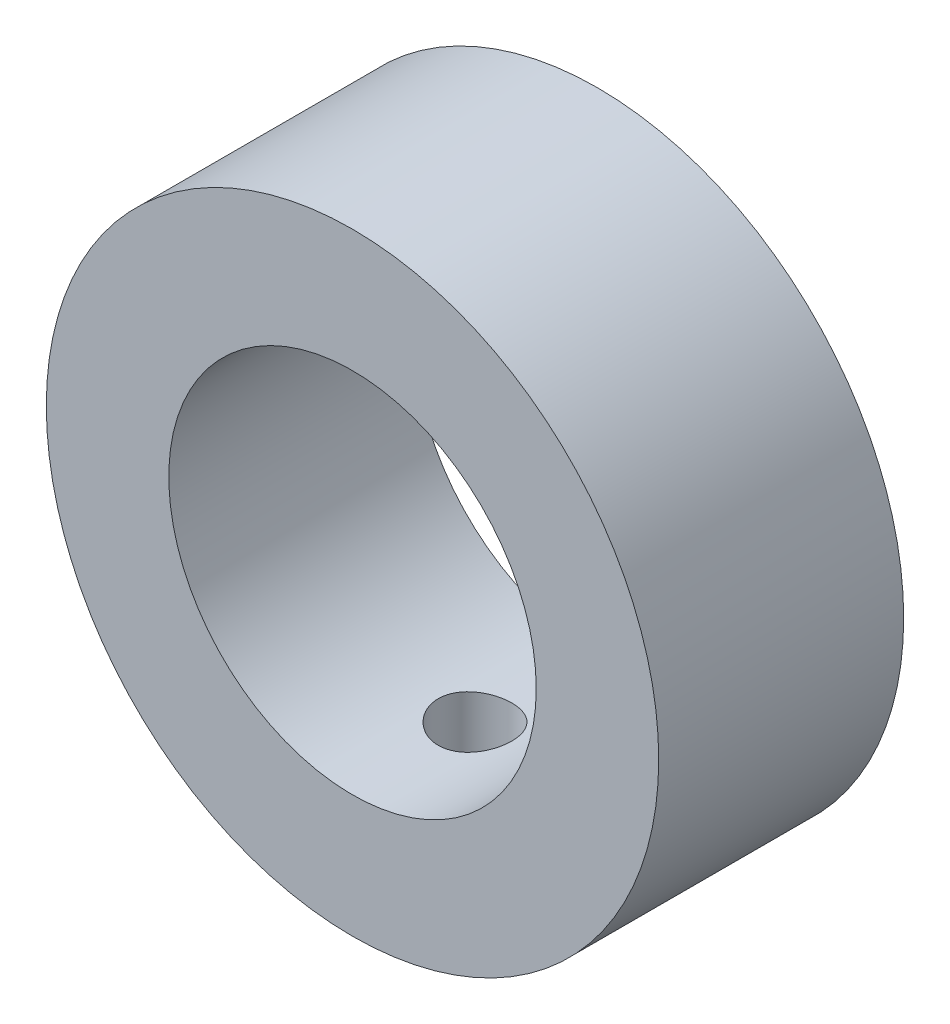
ISO-10303-21;
HEADER;
FILE_DESCRIPTION(('STEP AP214'),'2;1');
FILE_NAME('part.step','',(''),(''),'','','');
FILE_SCHEMA(('AUTOMOTIVE_DESIGN { 1 0 10303 214 1 1 1 1 }'));
ENDSEC;
DATA;
#1=APPLICATION_CONTEXT('core data for automotive mechanical design processes');
#2=APPLICATION_PROTOCOL_DEFINITION('international standard','automotive_design',2000,#1);
#3=PRODUCT_CONTEXT('',#1,'mechanical');
#4=PRODUCT('Part','Part','',(#3));
#5=PRODUCT_RELATED_PRODUCT_CATEGORY('part','',(#4));
#6=PRODUCT_DEFINITION_FORMATION('','',#4);
#7=PRODUCT_DEFINITION_CONTEXT('part definition',#1,'design');
#8=PRODUCT_DEFINITION('design','',#6,#7);
#9=PRODUCT_DEFINITION_SHAPE('','',#8);
#10=(LENGTH_UNIT() NAMED_UNIT(*) SI_UNIT(.MILLI.,.METRE.));
#11=(NAMED_UNIT(*) PLANE_ANGLE_UNIT() SI_UNIT($,.RADIAN.));
#12=(NAMED_UNIT(*) SI_UNIT($,.STERADIAN.) SOLID_ANGLE_UNIT());
#13=UNCERTAINTY_MEASURE_WITH_UNIT(LENGTH_MEASURE(1.E-05),#10,'distance_accuracy_value','');
#14=(GEOMETRIC_REPRESENTATION_CONTEXT(3) GLOBAL_UNCERTAINTY_ASSIGNED_CONTEXT((#13)) GLOBAL_UNIT_ASSIGNED_CONTEXT((#10,
#11,#12)) REPRESENTATION_CONTEXT('',''));
#15=CARTESIAN_POINT('',(0.,0.,0.));
#16=DIRECTION('',(0.,0.,1.));
#17=DIRECTION('',(1.,0.,0.));
#18=AXIS2_PLACEMENT_3D('',#15,#16,#17);
#19=CARTESIAN_POINT('',(0.,0.,10.));
#20=DIRECTION('',(0.,0.,-1.));
#21=DIRECTION('',(-1.,0.,0.));
#22=AXIS2_PLACEMENT_3D('',#19,#20,#21);
#23=CYLINDRICAL_SURFACE('',#22,25.);
#24=CARTESIAN_POINT('',(0.,-25.,3.));
#25=CARTESIAN_POINT('',(-0.167864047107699,-24.9999977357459,2.99999283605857));
#26=CARTESIAN_POINT('',(-0.335834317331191,-24.9982914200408,2.98586334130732));
#27=CARTESIAN_POINT('',(-0.66710457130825,-24.991648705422,2.92971893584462));
#28=CARTESIAN_POINT('',(-0.830399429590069,-24.9867088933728,2.88767455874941));
#29=CARTESIAN_POINT('',(-1.14747479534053,-24.9741559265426,2.77695372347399));
#30=CARTESIAN_POINT('',(-1.30126148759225,-24.9665445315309,2.70829479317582));
#31=CARTESIAN_POINT('',(-1.595099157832,-24.9494959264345,2.5463312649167));
#32=CARTESIAN_POINT('',(-1.73515256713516,-24.9400590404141,2.45303104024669));
#33=CARTESIAN_POINT('',(-1.99829131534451,-24.920360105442,2.24392513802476));
#34=CARTESIAN_POINT('',(-2.1212966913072,-24.9100945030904,2.12801915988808));
#35=CARTESIAN_POINT('',(-2.34615931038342,-24.8899239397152,1.8772070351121));
#36=CARTESIAN_POINT('',(-2.44801549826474,-24.8800189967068,1.74229994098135));
#37=CARTESIAN_POINT('',(-2.62798342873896,-24.8616560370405,1.45679917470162));
#38=CARTESIAN_POINT('',(-2.7060207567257,-24.8532025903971,1.30615827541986));
#39=CARTESIAN_POINT('',(-2.8356605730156,-24.8387461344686,0.993791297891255));
#40=CARTESIAN_POINT('',(-2.88726398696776,-24.8327430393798,0.832065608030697));
#41=CARTESIAN_POINT('',(-2.96232930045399,-24.8239006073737,0.502947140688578));
#42=CARTESIAN_POINT('',(-2.98592577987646,-24.8210461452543,0.335585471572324));
#43=CARTESIAN_POINT('',(-3.0047237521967,-24.8187777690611,-0.000744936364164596));
#44=CARTESIAN_POINT('',(-2.99992630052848,-24.8193637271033,-0.169713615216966));
#45=CARTESIAN_POINT('',(-2.96218316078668,-24.8238961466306,-0.50352596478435));
#46=CARTESIAN_POINT('',(-2.92938543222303,-24.8278249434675,-0.668386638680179));
#47=CARTESIAN_POINT('',(-2.83680346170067,-24.8385728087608,-0.990247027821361));
#48=CARTESIAN_POINT('',(-2.77701871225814,-24.8453919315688,-1.147246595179));
#49=CARTESIAN_POINT('',(-2.63199980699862,-24.8611722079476,-1.44938946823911));
#50=CARTESIAN_POINT('',(-2.54670106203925,-24.8701387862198,-1.59450147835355));
#51=CARTESIAN_POINT('',(-2.35312173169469,-24.8891993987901,-1.86840721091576));
#52=CARTESIAN_POINT('',(-2.24484017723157,-24.8992934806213,-1.99720024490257));
#53=CARTESIAN_POINT('',(-2.0075475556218,-24.9195503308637,-2.23567108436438));
#54=CARTESIAN_POINT('',(-1.87840890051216,-24.929713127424,-2.34522196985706));
#55=CARTESIAN_POINT('',(-1.60350795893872,-24.9489020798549,-2.54111152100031));
#56=CARTESIAN_POINT('',(-1.45774563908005,-24.9579282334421,-2.62745014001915));
#57=CARTESIAN_POINT('',(-1.15363930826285,-24.9738318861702,-2.77446328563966));
#58=CARTESIAN_POINT('',(-0.995291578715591,-24.9807087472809,-2.83513019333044));
#59=CARTESIAN_POINT('',(-0.67055602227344,-24.991533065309,-2.9289787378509));
#60=CARTESIAN_POINT('',(-0.504168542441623,-24.9954806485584,-2.96216156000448));
#61=CARTESIAN_POINT('',(-0.169174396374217,-24.9999852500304,-2.99993625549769));
#62=CARTESIAN_POINT('',(-0.000587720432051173,-25.0005630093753,-3.0047030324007));
#63=CARTESIAN_POINT('',(0.33498206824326,-24.9983187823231,-2.98597142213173));
#64=CARTESIAN_POINT('',(0.501965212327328,-24.9954968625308,-2.96247358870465));
#65=CARTESIAN_POINT('',(0.829074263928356,-24.9867833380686,-2.88802503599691));
#66=CARTESIAN_POINT('',(0.989219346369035,-24.9809010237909,-2.83715738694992));
#67=CARTESIAN_POINT('',(1.29870539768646,-24.9667255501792,-2.70949929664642));
#68=CARTESIAN_POINT('',(1.44804602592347,-24.9584323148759,-2.63270803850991));
#69=CARTESIAN_POINT('',(1.73246717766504,-24.9403085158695,-2.45495708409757));
#70=CARTESIAN_POINT('',(1.86747628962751,-24.9304708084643,-2.35388386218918));
#71=CARTESIAN_POINT('',(2.11867625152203,-24.9103817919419,-2.13059915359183));
#72=CARTESIAN_POINT('',(2.23486641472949,-24.9001304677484,-2.00838689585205));
#73=CARTESIAN_POINT('',(2.44574795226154,-24.8803059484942,-1.74552438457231));
#74=CARTESIAN_POINT('',(2.54032363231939,-24.8707365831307,-1.60478098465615));
#75=CARTESIAN_POINT('',(2.70449314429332,-24.8534214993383,-1.30930497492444));
#76=CARTESIAN_POINT('',(2.77408744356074,-24.8456757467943,-1.15457262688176));
#77=CARTESIAN_POINT('',(2.88612996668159,-24.8329105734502,-0.835889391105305));
#78=CARTESIAN_POINT('',(2.92864420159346,-24.8278845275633,-0.671961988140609));
#79=CARTESIAN_POINT('',(2.98553272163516,-24.8211085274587,-0.339231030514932));
#80=CARTESIAN_POINT('',(2.99990820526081,-24.8193584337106,-0.170427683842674));
#81=CARTESIAN_POINT('',(3.00009033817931,-24.819336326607,0.166112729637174));
#82=CARTESIAN_POINT('',(2.98607873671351,-24.8210421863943,0.333849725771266));
#83=CARTESIAN_POINT('',(2.93026848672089,-24.8276922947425,0.664566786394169));
#84=CARTESIAN_POINT('',(2.88846982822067,-24.8326365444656,0.827546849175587));
#85=CARTESIAN_POINT('',(2.77832739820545,-24.8451996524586,1.1441045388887));
#86=CARTESIAN_POINT('',(2.70999165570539,-24.8528177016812,1.29768499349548));
#87=CARTESIAN_POINT('',(2.5487328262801,-24.8698714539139,1.5912277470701));
#88=CARTESIAN_POINT('',(2.45580952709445,-24.8793071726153,1.73118992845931));
#89=CARTESIAN_POINT('',(2.24733689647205,-24.8990055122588,1.99445294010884));
#90=CARTESIAN_POINT('',(2.1316520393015,-24.9092728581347,2.11764610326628));
#91=CARTESIAN_POINT('',(1.88122093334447,-24.9294354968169,2.34294247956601));
#92=CARTESIAN_POINT('',(1.74647018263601,-24.939330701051,2.44504069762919));
#93=CARTESIAN_POINT('',(1.46119322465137,-24.9576721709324,2.62555057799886));
#94=CARTESIAN_POINT('',(1.31061323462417,-24.966113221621,2.70387772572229));
#95=CARTESIAN_POINT('',(0.998422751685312,-24.9805418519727,2.83402376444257));
#96=CARTESIAN_POINT('',(0.836824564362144,-24.9865321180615,2.88587169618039));
#97=CARTESIAN_POINT('',(0.561977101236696,-24.9939268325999,2.94906342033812));
#98=CARTESIAN_POINT('',(0.450466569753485,-24.996193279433,2.96813748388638));
#99=CARTESIAN_POINT('',(0.225986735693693,-24.9992306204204,2.99360814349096));
#100=CARTESIAN_POINT('',(0.113017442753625,-25.0000015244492,3.00000482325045));
#101=CARTESIAN_POINT('',(0.,-25.,3.));
#102=B_SPLINE_CURVE_WITH_KNOTS('',3,(#24,#25,#26,#27,#28,#29,#30,#31,#32,#33,#34,#35,#36,#37,
#38,#39,#40,#41,#42,#43,#44,#45,#46,#47,#48,#49,#50,#51,#52,#53,#54,#55,#56,#57,#58,#59,#60,#61,
#62,#63,#64,#65,#66,#67,#68,#69,#70,#71,#72,#73,#74,#75,#76,#77,#78,#79,#80,#81,#82,#83,#84,#85,
#86,#87,#88,#89,#90,#91,#92,#93,#94,#95,#96,#97,#98,#99,#100,#101),.UNSPECIFIED.,.T.,.F.,(4,2,2,
2,2,2,2,2,2,2,2,2,2,2,2,2,2,2,2,2,2,2,2,2,2,2,2,2,2,2,2,2,2,2,2,2,2,2,4),(0.,0.50317935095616,
1.00689069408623,1.5102708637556,2.01356175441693,2.51913872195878,3.02474090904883,
3.53190689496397,4.03905511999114,4.54375638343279,5.0484388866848,5.55047092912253,
6.05251241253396,6.55583573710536,7.05918028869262,7.56572944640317,8.07227962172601,
8.57898002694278,9.08565857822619,9.58921522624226,10.0927620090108,10.5947890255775,
11.0968318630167,11.6012692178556,12.1057249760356,12.6128207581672,13.119907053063,
13.6257524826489,14.1315763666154,14.6341719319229,15.1367676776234,15.6392114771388,
16.1416596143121,16.6471952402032,17.1528504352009,17.6602829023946,18.1671576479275,
18.5059342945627,18.8447087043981),.UNSPECIFIED.);
#103=CARTESIAN_POINT('',(0.,-25.,3.));
#104=VERTEX_POINT('',#103);
#105=EDGE_CURVE('E48',#104,#104,#102,.T.);
#106=ORIENTED_EDGE('',*,*,#105,.F.);
#107=EDGE_LOOP('',(#106));
#108=FACE_BOUND('',#107,.T.);
#109=CARTESIAN_POINT('',(0.,0.,10.));
#110=DIRECTION('',(0.,0.,1.));
#111=DIRECTION('',(1.,0.,0.));
#112=AXIS2_PLACEMENT_3D('',#109,#110,#111);
#113=CIRCLE('',#112,25.);
#114=CARTESIAN_POINT('',(25.,0.,10.));
#115=VERTEX_POINT('',#114);
#116=EDGE_CURVE('E10',#115,#115,#113,.T.);
#117=ORIENTED_EDGE('',*,*,#116,.F.);
#118=EDGE_LOOP('',(#117));
#119=FACE_BOUND('',#118,.T.);
#120=CARTESIAN_POINT('',(0.,0.,-10.));
#121=DIRECTION('',(0.,0.,1.));
#122=DIRECTION('',(1.,0.,0.));
#123=AXIS2_PLACEMENT_3D('',#120,#121,#122);
#124=CIRCLE('',#123,25.);
#125=CARTESIAN_POINT('',(25.,0.,-10.));
#126=VERTEX_POINT('',#125);
#127=EDGE_CURVE('E34',#126,#126,#124,.T.);
#128=ORIENTED_EDGE('',*,*,#127,.T.);
#129=EDGE_LOOP('',(#128));
#130=FACE_BOUND('',#129,.T.);
#131=ADVANCED_FACE('F31',(#108,#119,#130),#23,.T.);
#132=CARTESIAN_POINT('',(0.,0.,10.));
#133=DIRECTION('',(0.,0.,1.));
#134=DIRECTION('',(1.,0.,0.));
#135=AXIS2_PLACEMENT_3D('',#132,#133,#134);
#136=PLANE('',#135);
#137=CARTESIAN_POINT('',(0.,0.,10.));
#138=DIRECTION('',(0.,0.,1.));
#139=DIRECTION('',(1.,0.,0.));
#140=AXIS2_PLACEMENT_3D('',#137,#138,#139);
#141=CIRCLE('',#140,15.);
#142=CARTESIAN_POINT('',(15.,0.,10.));
#143=VERTEX_POINT('',#142);
#144=EDGE_CURVE('E45',#143,#143,#141,.T.);
#145=ORIENTED_EDGE('',*,*,#144,.F.);
#146=EDGE_LOOP('',(#145));
#147=FACE_BOUND('',#146,.T.);
#148=ORIENTED_EDGE('',*,*,#116,.T.);
#149=EDGE_LOOP('',(#148));
#150=FACE_BOUND('',#149,.T.);
#151=ADVANCED_FACE('F72',(#147,#150),#136,.T.);
#152=CARTESIAN_POINT('',(0.,0.,-10.));
#153=DIRECTION('',(0.,0.,1.));
#154=DIRECTION('',(1.,0.,0.));
#155=AXIS2_PLACEMENT_3D('',#152,#153,#154);
#156=PLANE('',#155);
#157=CARTESIAN_POINT('',(0.,0.,-10.));
#158=DIRECTION('',(0.,0.,1.));
#159=DIRECTION('',(1.,0.,0.));
#160=AXIS2_PLACEMENT_3D('',#157,#158,#159);
#161=CIRCLE('',#160,15.);
#162=CARTESIAN_POINT('',(15.,0.,-10.));
#163=VERTEX_POINT('',#162);
#164=EDGE_CURVE('E41',#163,#163,#161,.F.);
#165=ORIENTED_EDGE('',*,*,#164,.F.);
#166=EDGE_LOOP('',(#165));
#167=FACE_BOUND('',#166,.T.);
#168=ORIENTED_EDGE('',*,*,#127,.F.);
#169=EDGE_LOOP('',(#168));
#170=FACE_BOUND('',#169,.T.);
#171=ADVANCED_FACE('F70',(#167,#170),#156,.F.);
#172=CARTESIAN_POINT('',(0.,0.,-10.001));
#173=DIRECTION('',(0.,0.,1.));
#174=DIRECTION('',(1.,0.,0.));
#175=AXIS2_PLACEMENT_3D('',#172,#173,#174);
#176=CYLINDRICAL_SURFACE('',#175,15.);
#177=CARTESIAN_POINT('',(0.,-15.,3.));
#178=CARTESIAN_POINT('',(0.166730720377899,-14.9999969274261,2.99999386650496));
#179=CARTESIAN_POINT('',(0.333538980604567,-14.9971915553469,2.98605347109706));
#180=CARTESIAN_POINT('',(0.662440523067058,-14.9862709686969,2.93070449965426));
#181=CARTESIAN_POINT('',(0.824529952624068,-14.9781515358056,2.88927410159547));
#182=CARTESIAN_POINT('',(1.13919091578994,-14.9575094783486,2.78027617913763));
#183=CARTESIAN_POINT('',(1.2917714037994,-14.9449910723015,2.71273368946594));
#184=CARTESIAN_POINT('',(1.58342396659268,-14.9169119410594,2.55350325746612));
#185=CARTESIAN_POINT('',(1.72249684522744,-14.9013513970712,2.46181675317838));
#186=CARTESIAN_POINT('',(1.9850804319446,-14.8686649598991,2.2555845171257));
#187=CARTESIAN_POINT('',(2.10838185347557,-14.8515223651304,2.14077493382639));
#188=CARTESIAN_POINT('',(2.33411026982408,-14.8177254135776,1.89212275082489));
#189=CARTESIAN_POINT('',(2.43653563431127,-14.8010710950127,1.75827866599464));
#190=CARTESIAN_POINT('',(2.61849526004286,-14.7699732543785,1.47385142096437));
#191=CARTESIAN_POINT('',(2.6978128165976,-14.7555512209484,1.32312706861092));
#192=CARTESIAN_POINT('',(2.82991699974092,-14.7307880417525,1.01015454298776));
#193=CARTESIAN_POINT('',(2.88270624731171,-14.7204464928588,0.847907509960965));
#194=CARTESIAN_POINT('',(2.95957589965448,-14.7051841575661,0.518746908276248));
#195=CARTESIAN_POINT('',(2.98402349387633,-14.7001941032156,0.351922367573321));
#196=CARTESIAN_POINT('',(3.00465638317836,-14.6959912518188,0.0164705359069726));
#197=CARTESIAN_POINT('',(3.0008445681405,-14.6967778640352,-0.152156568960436));
#198=CARTESIAN_POINT('',(2.96536371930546,-14.7039765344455,-0.48374036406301));
#199=CARTESIAN_POINT('',(2.93411562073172,-14.7103035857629,-0.646744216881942));
#200=CARTESIAN_POINT('',(2.84531365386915,-14.7277363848,-0.965148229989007));
#201=CARTESIAN_POINT('',(2.78775852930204,-14.7388423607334,-1.12054802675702));
#202=CARTESIAN_POINT('',(2.64757435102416,-14.7646685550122,-1.4205457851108));
#203=CARTESIAN_POINT('',(2.56477845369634,-14.7794126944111,-1.56506363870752));
#204=CARTESIAN_POINT('',(2.37658072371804,-14.8108385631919,-1.83831254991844));
#205=CARTESIAN_POINT('',(2.27117629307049,-14.827520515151,-1.96704179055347));
#206=CARTESIAN_POINT('',(2.03849980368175,-14.8613106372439,-2.20748820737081));
#207=CARTESIAN_POINT('',(1.91086848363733,-14.8784210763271,-2.31885770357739));
#208=CARTESIAN_POINT('',(1.63855507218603,-14.9108654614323,-2.51866153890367));
#209=CARTESIAN_POINT('',(1.49387276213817,-14.9261993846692,-2.60709558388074));
#210=CARTESIAN_POINT('',(1.19117816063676,-14.9534007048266,-2.75858252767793));
#211=CARTESIAN_POINT('',(1.0331454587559,-14.9652626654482,-2.82159568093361));
#212=CARTESIAN_POINT('',(0.708446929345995,-14.9841422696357,-2.9200814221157));
#213=CARTESIAN_POINT('',(0.541782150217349,-14.9911605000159,-2.95555734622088));
#214=CARTESIAN_POINT('',(0.207538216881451,-14.999480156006,-2.99746936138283));
#215=CARTESIAN_POINT('',(0.0400209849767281,-15.0008752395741,-3.00438125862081));
#216=CARTESIAN_POINT('',(-0.293774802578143,-14.9980515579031,-2.99025042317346));
#217=CARTESIAN_POINT('',(-0.46005342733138,-14.9938331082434,-2.96920926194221));
#218=CARTESIAN_POINT('',(-0.785116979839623,-14.9803149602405,-2.90016487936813));
#219=CARTESIAN_POINT('',(-0.94395584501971,-14.9710612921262,-2.85240579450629));
#220=CARTESIAN_POINT('',(-1.251370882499,-14.948506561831,-2.73154805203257));
#221=CARTESIAN_POINT('',(-1.39994628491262,-14.9352051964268,-2.65844749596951));
#222=CARTESIAN_POINT('',(-1.68462352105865,-14.9057973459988,-2.48795252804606));
#223=CARTESIAN_POINT('',(-1.82055038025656,-14.8896585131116,-2.39027165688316));
#224=CARTESIAN_POINT('',(-2.07425405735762,-14.8564420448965,-2.17377242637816));
#225=CARTESIAN_POINT('',(-2.19202892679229,-14.8393643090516,-2.0549518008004));
#226=CARTESIAN_POINT('',(-2.40792177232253,-14.8058791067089,-1.79737994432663));
#227=CARTESIAN_POINT('',(-2.50571310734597,-14.7894858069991,-1.65835276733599));
#228=CARTESIAN_POINT('',(-2.67655626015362,-14.7595257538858,-1.36556591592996));
#229=CARTESIAN_POINT('',(-2.74960906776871,-14.7459588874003,-1.21180683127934));
#230=CARTESIAN_POINT('',(-2.86845552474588,-14.7233022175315,-0.894695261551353));
#231=CARTESIAN_POINT('',(-2.91439049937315,-14.7141892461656,-0.731397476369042));
#232=CARTESIAN_POINT('',(-2.97812595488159,-14.7014231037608,-0.399199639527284));
#233=CARTESIAN_POINT('',(-2.99593010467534,-14.6977692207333,-0.230300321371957));
#234=CARTESIAN_POINT('',(-3.00276273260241,-14.6963744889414,0.105026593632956));
#235=CARTESIAN_POINT('',(-2.99230736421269,-14.698527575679,0.271443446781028));
#236=CARTESIAN_POINT('',(-2.94405691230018,-14.7082672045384,0.600094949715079));
#237=CARTESIAN_POINT('',(-2.90626204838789,-14.7158537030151,0.762329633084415));
#238=CARTESIAN_POINT('',(-2.80463570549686,-14.7355579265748,1.07768313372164));
#239=CARTESIAN_POINT('',(-2.74086752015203,-14.7476646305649,1.23082308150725));
#240=CARTESIAN_POINT('',(-2.58916393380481,-14.7750514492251,1.52431116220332));
#241=CARTESIAN_POINT('',(-2.50122650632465,-14.7903318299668,1.66465822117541));
#242=CARTESIAN_POINT('',(-2.30191774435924,-14.8226688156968,1.93114671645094));
#243=CARTESIAN_POINT('',(-2.19017366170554,-14.839751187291,2.05700629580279));
#244=CARTESIAN_POINT('',(-1.94719310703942,-14.8735824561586,2.28835861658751));
#245=CARTESIAN_POINT('',(-1.81595216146,-14.8903312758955,2.39384667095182));
#246=CARTESIAN_POINT('',(-1.53605288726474,-14.9218149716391,2.58250393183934));
#247=CARTESIAN_POINT('',(-1.3872266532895,-14.9365269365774,2.66542800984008));
#248=CARTESIAN_POINT('',(-1.0774990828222,-14.96205375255,2.80495836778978));
#249=CARTESIAN_POINT('',(-0.916608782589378,-14.9728721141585,2.86158836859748));
#250=CARTESIAN_POINT('',(-0.629464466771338,-14.9872911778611,2.93595584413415));
#251=CARTESIAN_POINT('',(-0.504844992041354,-14.9920290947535,2.95992958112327));
#252=CARTESIAN_POINT('',(-0.253498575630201,-14.9983846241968,2.99195373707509));
#253=CARTESIAN_POINT('',(-0.126771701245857,-15.0000023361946,3.0000046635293));
#254=CARTESIAN_POINT('',(0.,-15.,3.));
#255=B_SPLINE_CURVE_WITH_KNOTS('',3,(#177,#178,#179,#180,#181,#182,#183,#184,#185,#186,#187,
#188,#189,#190,#191,#192,#193,#194,#195,#196,#197,#198,#199,#200,#201,#202,#203,#204,#205,#206,
#207,#208,#209,#210,#211,#212,#213,#214,#215,#216,#217,#218,#219,#220,#221,#222,#223,#224,#225,
#226,#227,#228,#229,#230,#231,#232,#233,#234,#235,#236,#237,#238,#239,#240,#241,#242,#243,#244,
#245,#246,#247,#248,#249,#250,#251,#252,#253,#254),.UNSPECIFIED.,.T.,.F.,(4,2,2,2,2,2,2,2,2,2,2,
2,2,2,2,2,2,2,2,2,2,2,2,2,2,2,2,2,2,2,2,2,2,2,2,2,2,2,4),(0.,0.499728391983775,
0.999853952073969,1.49950120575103,1.99911870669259,2.50479801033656,3.0105167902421,
3.52083585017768,4.03110448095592,4.53468555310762,5.03821512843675,5.53415181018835,
6.03011217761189,6.52942470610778,7.02879464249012,7.53714757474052,8.04550702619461,
8.55465824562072,9.06374777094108,9.56432207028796,10.064868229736,10.5609136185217,
11.0569961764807,11.5591519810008,12.0613616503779,12.5712188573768,13.081055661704,
13.5882114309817,14.0953010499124,14.593191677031,15.0910783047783,15.5877588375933,
16.084481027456,16.5896422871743,17.0949196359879,17.6054849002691,18.1155886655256,
18.4955632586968,18.8755257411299),.UNSPECIFIED.);
#256=CARTESIAN_POINT('',(0.,-15.,3.));
#257=VERTEX_POINT('',#256);
#258=EDGE_CURVE('E55',#257,#257,#255,.T.);
#259=ORIENTED_EDGE('',*,*,#258,.F.);
#260=EDGE_LOOP('',(#259));
#261=FACE_BOUND('',#260,.T.);
#262=ORIENTED_EDGE('',*,*,#144,.T.);
#263=EDGE_LOOP('',(#262));
#264=FACE_BOUND('',#263,.T.);
#265=ORIENTED_EDGE('',*,*,#164,.T.);
#266=EDGE_LOOP('',(#265));
#267=FACE_BOUND('',#266,.T.);
#268=ADVANCED_FACE('F65',(#261,#264,#267),#176,.F.);
#269=CARTESIAN_POINT('',(0.,-25.001,0.));
#270=DIRECTION('',(0.,1.,0.));
#271=DIRECTION('',(0.,0.,1.));
#272=AXIS2_PLACEMENT_3D('',#269,#270,#271);
#273=CYLINDRICAL_SURFACE('',#272,3.);
#274=ORIENTED_EDGE('',*,*,#258,.T.);
#275=EDGE_LOOP('',(#274));
#276=FACE_BOUND('',#275,.T.);
#277=ORIENTED_EDGE('',*,*,#105,.T.);
#278=EDGE_LOOP('',(#277));
#279=FACE_BOUND('',#278,.T.);
#280=ADVANCED_FACE('F59',(#276,#279),#273,.F.);
#281=CLOSED_SHELL('',(#131,#151,#171,#268,#280));
#282=MANIFOLD_SOLID_BREP('B2',#281);
#283=ADVANCED_BREP_SHAPE_REPRESENTATION('',(#18,#282),#14);
#284=SHAPE_DEFINITION_REPRESENTATION(#9,#283);
ENDSEC;
END-ISO-10303-21;
